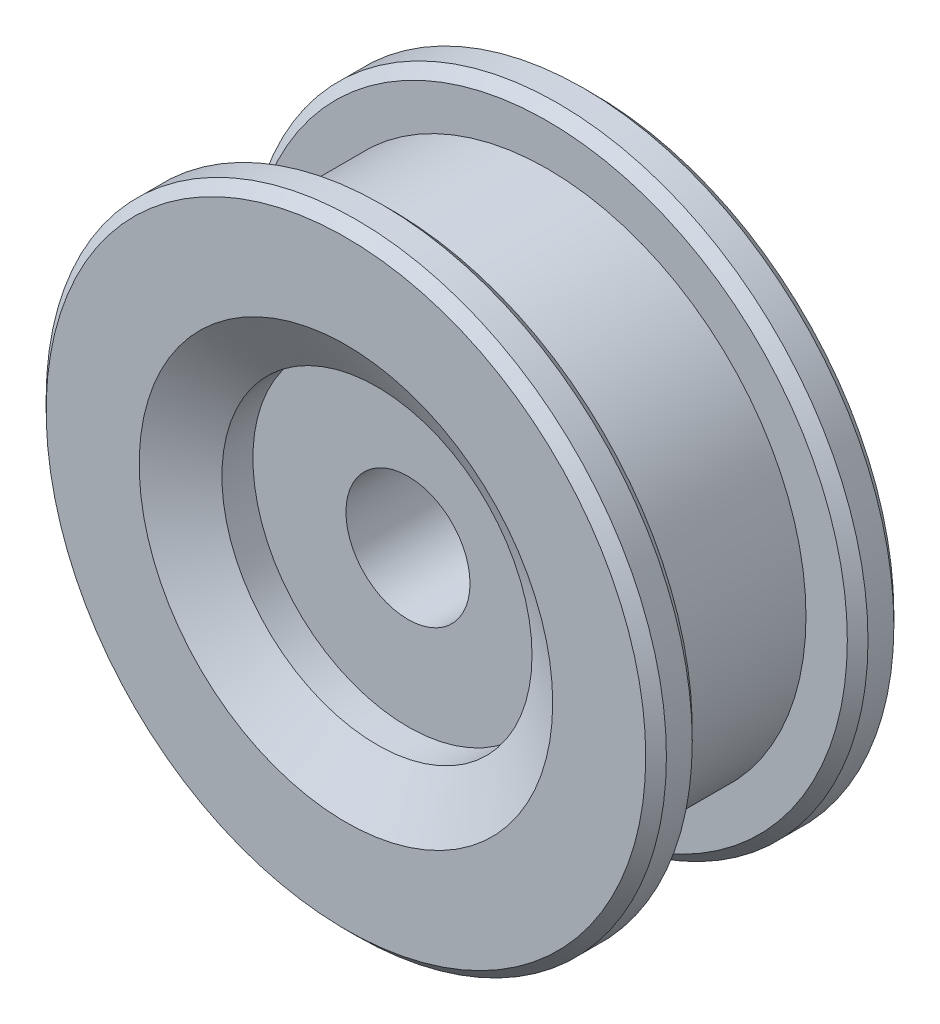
ISO-10303-21;
HEADER;
FILE_DESCRIPTION(('STEP AP214'),'2;1');
FILE_NAME('part.step','',(''),(''),'','','');
FILE_SCHEMA(('AUTOMOTIVE_DESIGN { 1 0 10303 214 1 1 1 1 }'));
ENDSEC;
DATA;
#1=APPLICATION_CONTEXT('core data for automotive mechanical design processes');
#2=APPLICATION_PROTOCOL_DEFINITION('international standard','automotive_design',2000,#1);
#3=PRODUCT_CONTEXT('',#1,'mechanical');
#4=PRODUCT('Part','Part','',(#3));
#5=PRODUCT_RELATED_PRODUCT_CATEGORY('part','',(#4));
#6=PRODUCT_DEFINITION_FORMATION('','',#4);
#7=PRODUCT_DEFINITION_CONTEXT('part definition',#1,'design');
#8=PRODUCT_DEFINITION('design','',#6,#7);
#9=PRODUCT_DEFINITION_SHAPE('','',#8);
#10=(LENGTH_UNIT() NAMED_UNIT(*) SI_UNIT(.MILLI.,.METRE.));
#11=(NAMED_UNIT(*) PLANE_ANGLE_UNIT() SI_UNIT($,.RADIAN.));
#12=(NAMED_UNIT(*) SI_UNIT($,.STERADIAN.) SOLID_ANGLE_UNIT());
#13=UNCERTAINTY_MEASURE_WITH_UNIT(LENGTH_MEASURE(1.E-05),#10,'distance_accuracy_value','');
#14=(GEOMETRIC_REPRESENTATION_CONTEXT(3) GLOBAL_UNCERTAINTY_ASSIGNED_CONTEXT((#13)) GLOBAL_UNIT_ASSIGNED_CONTEXT((#10,
#11,#12)) REPRESENTATION_CONTEXT('',''));
#15=CARTESIAN_POINT('',(0.,0.,0.));
#16=DIRECTION('',(0.,0.,1.));
#17=DIRECTION('',(1.,0.,0.));
#18=AXIS2_PLACEMENT_3D('',#15,#16,#17);
#19=CARTESIAN_POINT('',(0.,0.,6.));
#20=DIRECTION('',(0.,0.,-1.));
#21=DIRECTION('',(-1.,0.,0.));
#22=AXIS2_PLACEMENT_3D('',#19,#20,#21);
#23=CYLINDRICAL_SURFACE('',#22,3.);
#24=CARTESIAN_POINT('',(0.,0.,-3.));
#25=DIRECTION('',(0.,0.,-1.));
#26=DIRECTION('',(-1.,0.,0.));
#27=AXIS2_PLACEMENT_3D('',#24,#25,#26);
#28=CIRCLE('',#27,3.);
#29=CARTESIAN_POINT('',(-3.,0.,-3.));
#30=VERTEX_POINT('',#29);
#31=EDGE_CURVE('E29',#30,#30,#28,.F.);
#32=ORIENTED_EDGE('',*,*,#31,.F.);
#33=EDGE_LOOP('',(#32));
#34=FACE_BOUND('',#33,.T.);
#35=CARTESIAN_POINT('',(0.,0.,3.));
#36=DIRECTION('',(0.,0.,1.));
#37=DIRECTION('',(1.,0.,0.));
#38=AXIS2_PLACEMENT_3D('',#35,#36,#37);
#39=CIRCLE('',#38,3.);
#40=CARTESIAN_POINT('',(3.,0.,3.));
#41=VERTEX_POINT('',#40);
#42=EDGE_CURVE('E16',#41,#41,#39,.F.);
#43=ORIENTED_EDGE('',*,*,#42,.F.);
#44=EDGE_LOOP('',(#43));
#45=FACE_BOUND('',#44,.T.);
#46=ADVANCED_FACE('F12',(#34,#45),#23,.F.);
#47=CARTESIAN_POINT('',(0.,0.,6.));
#48=DIRECTION('',(0.,0.,-1.));
#49=DIRECTION('',(-1.,0.,0.));
#50=AXIS2_PLACEMENT_3D('',#47,#48,#49);
#51=CYLINDRICAL_SURFACE('',#50,15.);
#52=CARTESIAN_POINT('',(0.,0.,5.5));
#53=DIRECTION('',(0.,0.,1.));
#54=DIRECTION('',(1.,0.,0.));
#55=AXIS2_PLACEMENT_3D('',#52,#53,#54);
#56=CIRCLE('',#55,15.);
#57=CARTESIAN_POINT('',(15.,0.,5.5));
#58=VERTEX_POINT('',#57);
#59=EDGE_CURVE('E66',#58,#58,#56,.F.);
#60=ORIENTED_EDGE('',*,*,#59,.T.);
#61=EDGE_LOOP('',(#60));
#62=FACE_BOUND('',#61,.T.);
#63=CARTESIAN_POINT('',(0.,0.,4.25));
#64=DIRECTION('',(0.,0.,-1.));
#65=DIRECTION('',(-1.,0.,0.));
#66=AXIS2_PLACEMENT_3D('',#63,#64,#65);
#67=CIRCLE('',#66,15.);
#68=CARTESIAN_POINT('',(-15.,0.,4.25));
#69=VERTEX_POINT('',#68);
#70=EDGE_CURVE('E63',#69,#69,#67,.F.);
#71=ORIENTED_EDGE('',*,*,#70,.T.);
#72=EDGE_LOOP('',(#71));
#73=FACE_BOUND('',#72,.T.);
#74=ADVANCED_FACE('F14',(#62,#73),#51,.T.);
#75=CARTESIAN_POINT('',(0.,0.,6.));
#76=DIRECTION('',(0.,0.,1.));
#77=DIRECTION('',(1.,0.,0.));
#78=AXIS2_PLACEMENT_3D('',#75,#76,#77);
#79=PLANE('',#78);
#80=CARTESIAN_POINT('',(0.,0.,6.));
#81=DIRECTION('',(0.,0.,1.));
#82=DIRECTION('',(1.,0.,0.));
#83=AXIS2_PLACEMENT_3D('',#80,#81,#82);
#84=CIRCLE('',#83,14.5);
#85=CARTESIAN_POINT('',(14.5,0.,6.));
#86=VERTEX_POINT('',#85);
#87=EDGE_CURVE('E60',#86,#86,#84,.T.);
#88=ORIENTED_EDGE('',*,*,#87,.T.);
#89=EDGE_LOOP('',(#88));
#90=FACE_BOUND('',#89,.T.);
#91=CARTESIAN_POINT('',(0.,0.,6.));
#92=DIRECTION('',(0.,0.,1.));
#93=DIRECTION('',(1.,0.,0.));
#94=AXIS2_PLACEMENT_3D('',#91,#92,#93);
#95=CIRCLE('',#94,10.);
#96=CARTESIAN_POINT('',(10.,0.,6.));
#97=VERTEX_POINT('',#96);
#98=EDGE_CURVE('E35',#97,#97,#95,.T.);
#99=ORIENTED_EDGE('',*,*,#98,.F.);
#100=EDGE_LOOP('',(#99));
#101=FACE_BOUND('',#100,.T.);
#102=ADVANCED_FACE('F104',(#90,#101),#79,.T.);
#103=CARTESIAN_POINT('',(0.,22.5,3.75));
#104=DIRECTION('',(0.,0.,-1.));
#105=DIRECTION('',(-1.,0.,0.));
#106=AXIS2_PLACEMENT_3D('',#103,#104,#105);
#107=PLANE('',#106);
#108=CARTESIAN_POINT('',(0.,0.,3.75));
#109=DIRECTION('',(0.,0.,-1.));
#110=DIRECTION('',(-1.,0.,0.));
#111=AXIS2_PLACEMENT_3D('',#108,#109,#110);
#112=CIRCLE('',#111,14.5);
#113=CARTESIAN_POINT('',(-14.5,0.,3.75));
#114=VERTEX_POINT('',#113);
#115=EDGE_CURVE('E69',#114,#114,#112,.T.);
#116=ORIENTED_EDGE('',*,*,#115,.T.);
#117=EDGE_LOOP('',(#116));
#118=FACE_BOUND('',#117,.T.);
#119=CARTESIAN_POINT('',(0.,0.,3.75));
#120=DIRECTION('',(0.,0.,1.));
#121=DIRECTION('',(1.,0.,0.));
#122=AXIS2_PLACEMENT_3D('',#119,#120,#121);
#123=CIRCLE('',#122,12.5);
#124=CARTESIAN_POINT('',(12.5,0.,3.75));
#125=VERTEX_POINT('',#124);
#126=EDGE_CURVE('E57',#125,#125,#123,.T.);
#127=ORIENTED_EDGE('',*,*,#126,.T.);
#128=EDGE_LOOP('',(#127));
#129=FACE_BOUND('',#128,.T.);
#130=ADVANCED_FACE('F116',(#118,#129),#107,.T.);
#131=CARTESIAN_POINT('',(0.,22.5,-3.75));
#132=DIRECTION('',(0.,0.,1.));
#133=DIRECTION('',(1.,0.,0.));
#134=AXIS2_PLACEMENT_3D('',#131,#132,#133);
#135=PLANE('',#134);
#136=CARTESIAN_POINT('',(0.,0.,-3.75));
#137=DIRECTION('',(0.,0.,1.));
#138=DIRECTION('',(1.,0.,0.));
#139=AXIS2_PLACEMENT_3D('',#136,#137,#138);
#140=CIRCLE('',#139,14.5);
#141=CARTESIAN_POINT('',(14.5,0.,-3.75));
#142=VERTEX_POINT('',#141);
#143=EDGE_CURVE('E72',#142,#142,#140,.T.);
#144=ORIENTED_EDGE('',*,*,#143,.T.);
#145=EDGE_LOOP('',(#144));
#146=FACE_BOUND('',#145,.T.);
#147=CARTESIAN_POINT('',(0.,0.,-3.75));
#148=DIRECTION('',(0.,0.,1.));
#149=DIRECTION('',(1.,0.,0.));
#150=AXIS2_PLACEMENT_3D('',#147,#148,#149);
#151=CIRCLE('',#150,12.5);
#152=CARTESIAN_POINT('',(12.5,0.,-3.75));
#153=VERTEX_POINT('',#152);
#154=EDGE_CURVE('E54',#153,#153,#151,.T.);
#155=ORIENTED_EDGE('',*,*,#154,.F.);
#156=EDGE_LOOP('',(#155));
#157=FACE_BOUND('',#156,.T.);
#158=ADVANCED_FACE('F112',(#146,#157),#135,.T.);
#159=CARTESIAN_POINT('',(0.,0.,19.8769703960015));
#160=DIRECTION('',(0.,0.,1.));
#161=DIRECTION('',(1.,0.,0.));
#162=AXIS2_PLACEMENT_3D('',#159,#160,#161);
#163=CYLINDRICAL_SURFACE('',#162,12.5);
#164=ORIENTED_EDGE('',*,*,#154,.T.);
#165=EDGE_LOOP('',(#164));
#166=FACE_BOUND('',#165,.T.);
#167=ORIENTED_EDGE('',*,*,#126,.F.);
#168=EDGE_LOOP('',(#167));
#169=FACE_BOUND('',#168,.T.);
#170=ADVANCED_FACE('F115',(#166,#169),#163,.T.);
#171=CARTESIAN_POINT('',(0.,0.,-6.));
#172=DIRECTION('',(0.,0.,1.));
#173=DIRECTION('',(1.,0.,0.));
#174=AXIS2_PLACEMENT_3D('',#171,#172,#173);
#175=PLANE('',#174);
#176=CARTESIAN_POINT('',(0.,0.,-6.));
#177=DIRECTION('',(0.,0.,1.));
#178=DIRECTION('',(1.,0.,0.));
#179=AXIS2_PLACEMENT_3D('',#176,#177,#178);
#180=CIRCLE('',#179,14.5);
#181=CARTESIAN_POINT('',(14.5,0.,-6.));
#182=VERTEX_POINT('',#181);
#183=EDGE_CURVE('E8',#182,#182,#180,.F.);
#184=ORIENTED_EDGE('',*,*,#183,.T.);
#185=EDGE_LOOP('',(#184));
#186=FACE_BOUND('',#185,.T.);
#187=CARTESIAN_POINT('',(0.,0.,-6.));
#188=DIRECTION('',(0.,0.,-1.));
#189=DIRECTION('',(-1.,0.,0.));
#190=AXIS2_PLACEMENT_3D('',#187,#188,#189);
#191=CIRCLE('',#190,10.);
#192=CARTESIAN_POINT('',(-10.,0.,-6.));
#193=VERTEX_POINT('',#192);
#194=EDGE_CURVE('E51',#193,#193,#191,.T.);
#195=ORIENTED_EDGE('',*,*,#194,.F.);
#196=EDGE_LOOP('',(#195));
#197=FACE_BOUND('',#196,.T.);
#198=ADVANCED_FACE('F120',(#186,#197),#175,.F.);
#199=CARTESIAN_POINT('',(0.,0.,-4.25));
#200=DIRECTION('',(0.,0.,1.));
#201=DIRECTION('',(1.,0.,0.));
#202=AXIS2_PLACEMENT_3D('',#199,#200,#201);
#203=CIRCLE('',#202,15.);
#204=CARTESIAN_POINT('',(15.,0.,-4.25));
#205=VERTEX_POINT('',#204);
#206=EDGE_CURVE('E20',#205,#205,#203,.F.);
#207=ORIENTED_EDGE('',*,*,#206,.T.);
#208=EDGE_LOOP('',(#207));
#209=FACE_BOUND('',#208,.T.);
#210=CARTESIAN_POINT('',(0.,0.,-5.5));
#211=DIRECTION('',(0.,0.,1.));
#212=DIRECTION('',(1.,0.,0.));
#213=AXIS2_PLACEMENT_3D('',#210,#211,#212);
#214=CIRCLE('',#213,15.);
#215=CARTESIAN_POINT('',(15.,0.,-5.5));
#216=VERTEX_POINT('',#215);
#217=EDGE_CURVE('E25',#216,#216,#214,.T.);
#218=ORIENTED_EDGE('',*,*,#217,.T.);
#219=EDGE_LOOP('',(#218));
#220=FACE_BOUND('',#219,.T.);
#221=ADVANCED_FACE('F77',(#209,#220),#51,.T.);
#222=CARTESIAN_POINT('',(0.,0.,6.));
#223=DIRECTION('',(0.,0.,-1.));
#224=DIRECTION('',(-1.,0.,0.));
#225=AXIS2_PLACEMENT_3D('',#222,#223,#224);
#226=CONICAL_SURFACE('',#225,14.5,0.785398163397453);
#227=ORIENTED_EDGE('',*,*,#59,.F.);
#228=EDGE_LOOP('',(#227));
#229=FACE_BOUND('',#228,.T.);
#230=ORIENTED_EDGE('',*,*,#87,.F.);
#231=EDGE_LOOP('',(#230));
#232=FACE_BOUND('',#231,.T.);
#233=ADVANCED_FACE('F110',(#229,#232),#226,.T.);
#234=CARTESIAN_POINT('',(0.,0.,3.75));
#235=DIRECTION('',(0.,0.,1.));
#236=DIRECTION('',(1.,0.,0.));
#237=AXIS2_PLACEMENT_3D('',#234,#235,#236);
#238=CONICAL_SURFACE('',#237,14.5,0.785398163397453);
#239=ORIENTED_EDGE('',*,*,#70,.F.);
#240=EDGE_LOOP('',(#239));
#241=FACE_BOUND('',#240,.T.);
#242=ORIENTED_EDGE('',*,*,#115,.F.);
#243=EDGE_LOOP('',(#242));
#244=FACE_BOUND('',#243,.T.);
#245=ADVANCED_FACE('F94',(#241,#244),#238,.T.);
#246=CARTESIAN_POINT('',(0.,0.,-3.75));
#247=DIRECTION('',(0.,0.,-1.));
#248=DIRECTION('',(-1.,0.,0.));
#249=AXIS2_PLACEMENT_3D('',#246,#247,#248);
#250=CONICAL_SURFACE('',#249,14.5,0.785398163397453);
#251=ORIENTED_EDGE('',*,*,#206,.F.);
#252=EDGE_LOOP('',(#251));
#253=FACE_BOUND('',#252,.T.);
#254=ORIENTED_EDGE('',*,*,#143,.F.);
#255=EDGE_LOOP('',(#254));
#256=FACE_BOUND('',#255,.T.);
#257=ADVANCED_FACE('F82',(#253,#256),#250,.T.);
#258=CARTESIAN_POINT('',(0.,0.,-5.5));
#259=DIRECTION('',(0.,0.,1.));
#260=DIRECTION('',(1.,0.,0.));
#261=AXIS2_PLACEMENT_3D('',#258,#259,#260);
#262=CONICAL_SURFACE('',#261,15.,0.78539816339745);
#263=ORIENTED_EDGE('',*,*,#183,.F.);
#264=EDGE_LOOP('',(#263));
#265=FACE_BOUND('',#264,.T.);
#266=ORIENTED_EDGE('',*,*,#217,.F.);
#267=EDGE_LOOP('',(#266));
#268=FACE_BOUND('',#267,.T.);
#269=ADVANCED_FACE('F79',(#265,#268),#262,.T.);
#270=CARTESIAN_POINT('',(0.,0.,-3.));
#271=DIRECTION('',(0.,0.,-1.));
#272=DIRECTION('',(-1.,0.,0.));
#273=AXIS2_PLACEMENT_3D('',#270,#271,#272);
#274=PLANE('',#273);
#275=CARTESIAN_POINT('',(0.,0.,-3.));
#276=DIRECTION('',(0.,0.,1.));
#277=DIRECTION('',(1.,0.,0.));
#278=AXIS2_PLACEMENT_3D('',#275,#276,#277);
#279=CIRCLE('',#278,7.5);
#280=CARTESIAN_POINT('',(7.5,0.,-3.));
#281=VERTEX_POINT('',#280);
#282=EDGE_CURVE('E33',#281,#281,#279,.T.);
#283=ORIENTED_EDGE('',*,*,#282,.F.);
#284=EDGE_LOOP('',(#283));
#285=FACE_BOUND('',#284,.T.);
#286=ORIENTED_EDGE('',*,*,#31,.T.);
#287=EDGE_LOOP('',(#286));
#288=FACE_BOUND('',#287,.T.);
#289=ADVANCED_FACE('F81',(#285,#288),#274,.T.);
#290=CARTESIAN_POINT('',(0.,0.,9.8539660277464));
#291=DIRECTION('',(0.,0.,1.));
#292=DIRECTION('',(1.,0.,0.));
#293=AXIS2_PLACEMENT_3D('',#290,#291,#292);
#294=CYLINDRICAL_SURFACE('',#293,7.5);
#295=CARTESIAN_POINT('',(0.,0.,-4.5));
#296=DIRECTION('',(0.,0.,-1.));
#297=DIRECTION('',(-1.,0.,0.));
#298=AXIS2_PLACEMENT_3D('',#295,#296,#297);
#299=CIRCLE('',#298,7.5);
#300=CARTESIAN_POINT('',(-7.5,0.,-4.5));
#301=VERTEX_POINT('',#300);
#302=EDGE_CURVE('E32',#301,#301,#299,.F.);
#303=ORIENTED_EDGE('',*,*,#302,.F.);
#304=EDGE_LOOP('',(#303));
#305=FACE_BOUND('',#304,.T.);
#306=ORIENTED_EDGE('',*,*,#282,.T.);
#307=EDGE_LOOP('',(#306));
#308=FACE_BOUND('',#307,.T.);
#309=ADVANCED_FACE('F91',(#305,#308),#294,.F.);
#310=CARTESIAN_POINT('',(0.,0.,3.));
#311=DIRECTION('',(0.,0.,1.));
#312=DIRECTION('',(1.,0.,0.));
#313=AXIS2_PLACEMENT_3D('',#310,#311,#312);
#314=PLANE('',#313);
#315=CARTESIAN_POINT('',(0.,0.,3.));
#316=DIRECTION('',(0.,0.,1.));
#317=DIRECTION('',(1.,0.,0.));
#318=AXIS2_PLACEMENT_3D('',#315,#316,#317);
#319=CIRCLE('',#318,7.5);
#320=CARTESIAN_POINT('',(7.5,0.,3.));
#321=VERTEX_POINT('',#320);
#322=EDGE_CURVE('E38',#321,#321,#319,.T.);
#323=ORIENTED_EDGE('',*,*,#322,.T.);
#324=EDGE_LOOP('',(#323));
#325=FACE_BOUND('',#324,.T.);
#326=ORIENTED_EDGE('',*,*,#42,.T.);
#327=EDGE_LOOP('',(#326));
#328=FACE_BOUND('',#327,.T.);
#329=ADVANCED_FACE('F147',(#325,#328),#314,.T.);
#330=CARTESIAN_POINT('',(0.,0.,9.8539660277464));
#331=DIRECTION('',(0.,0.,1.));
#332=DIRECTION('',(1.,0.,0.));
#333=AXIS2_PLACEMENT_3D('',#330,#331,#332);
#334=CYLINDRICAL_SURFACE('',#333,7.5);
#335=CARTESIAN_POINT('',(0.,0.,4.5));
#336=DIRECTION('',(0.,0.,1.));
#337=DIRECTION('',(1.,0.,0.));
#338=AXIS2_PLACEMENT_3D('',#335,#336,#337);
#339=CIRCLE('',#338,7.5);
#340=CARTESIAN_POINT('',(7.5,0.,4.5));
#341=VERTEX_POINT('',#340);
#342=EDGE_CURVE('E36',#341,#341,#339,.F.);
#343=ORIENTED_EDGE('',*,*,#342,.F.);
#344=EDGE_LOOP('',(#343));
#345=FACE_BOUND('',#344,.T.);
#346=ORIENTED_EDGE('',*,*,#322,.F.);
#347=EDGE_LOOP('',(#346));
#348=FACE_BOUND('',#347,.T.);
#349=ADVANCED_FACE('F138',(#345,#348),#334,.F.);
#350=CARTESIAN_POINT('',(0.,0.,6.));
#351=DIRECTION('',(0.,0.,1.));
#352=DIRECTION('',(1.,0.,0.));
#353=AXIS2_PLACEMENT_3D('',#350,#351,#352);
#354=CONICAL_SURFACE('',#353,10.,1.03037682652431);
#355=ORIENTED_EDGE('',*,*,#342,.T.);
#356=EDGE_LOOP('',(#355));
#357=FACE_BOUND('',#356,.T.);
#358=ORIENTED_EDGE('',*,*,#98,.T.);
#359=EDGE_LOOP('',(#358));
#360=FACE_BOUND('',#359,.T.);
#361=ADVANCED_FACE('F135',(#357,#360),#354,.F.);
#362=CARTESIAN_POINT('',(0.,0.,-4.5));
#363=DIRECTION('',(0.,0.,-1.));
#364=DIRECTION('',(-1.,0.,0.));
#365=AXIS2_PLACEMENT_3D('',#362,#363,#364);
#366=CONICAL_SURFACE('',#365,7.5,1.03037682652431);
#367=ORIENTED_EDGE('',*,*,#194,.T.);
#368=EDGE_LOOP('',(#367));
#369=FACE_BOUND('',#368,.T.);
#370=ORIENTED_EDGE('',*,*,#302,.T.);
#371=EDGE_LOOP('',(#370));
#372=FACE_BOUND('',#371,.T.);
#373=ADVANCED_FACE('F137',(#369,#372),#366,.F.);
#374=CLOSED_SHELL('',(#46,#74,#102,#130,#158,#170,#198,#221,#233,#245,#257,#269,#289,#309,#329,
#349,#361,#373));
#375=MANIFOLD_SOLID_BREP('B1',#374);
#376=ADVANCED_BREP_SHAPE_REPRESENTATION('',(#18,#375),#14);
#377=SHAPE_DEFINITION_REPRESENTATION(#9,#376);
ENDSEC;
END-ISO-10303-21;
